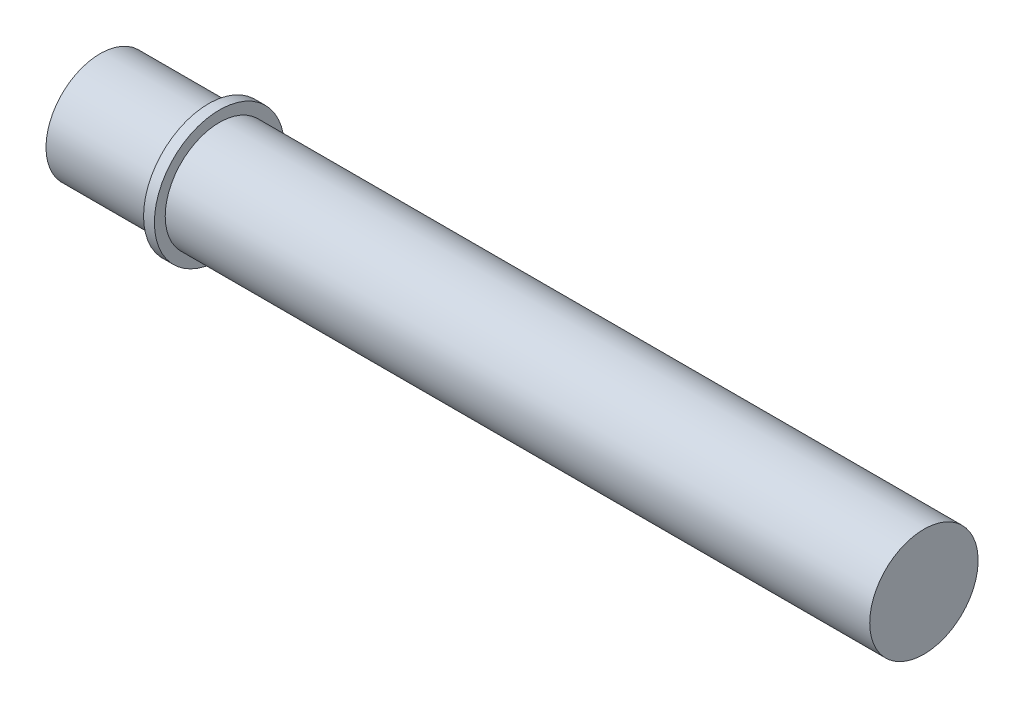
ISO-10303-21;
HEADER;
FILE_DESCRIPTION(('STEP AP214'),'2;1');
FILE_NAME('part.step','',(''),(''),'','','');
FILE_SCHEMA(('AUTOMOTIVE_DESIGN { 1 0 10303 214 1 1 1 1 }'));
ENDSEC;
DATA;
#1=APPLICATION_CONTEXT('core data for automotive mechanical design processes');
#2=APPLICATION_PROTOCOL_DEFINITION('international standard','automotive_design',2000,#1);
#3=PRODUCT_CONTEXT('',#1,'mechanical');
#4=PRODUCT('Part','Part','',(#3));
#5=PRODUCT_RELATED_PRODUCT_CATEGORY('part','',(#4));
#6=PRODUCT_DEFINITION_FORMATION('','',#4);
#7=PRODUCT_DEFINITION_CONTEXT('part definition',#1,'design');
#8=PRODUCT_DEFINITION('design','',#6,#7);
#9=PRODUCT_DEFINITION_SHAPE('','',#8);
#10=(LENGTH_UNIT() NAMED_UNIT(*) SI_UNIT(.MILLI.,.METRE.));
#11=(NAMED_UNIT(*) PLANE_ANGLE_UNIT() SI_UNIT($,.RADIAN.));
#12=(NAMED_UNIT(*) SI_UNIT($,.STERADIAN.) SOLID_ANGLE_UNIT());
#13=UNCERTAINTY_MEASURE_WITH_UNIT(LENGTH_MEASURE(1.E-05),#10,'distance_accuracy_value','');
#14=(GEOMETRIC_REPRESENTATION_CONTEXT(3) GLOBAL_UNCERTAINTY_ASSIGNED_CONTEXT((#13)) GLOBAL_UNIT_ASSIGNED_CONTEXT((#10,
#11,#12)) REPRESENTATION_CONTEXT('',''));
#15=CARTESIAN_POINT('',(0.,0.,0.));
#16=DIRECTION('',(0.,0.,1.));
#17=DIRECTION('',(1.,0.,0.));
#18=AXIS2_PLACEMENT_3D('',#15,#16,#17);
#19=CARTESIAN_POINT('',(0.,0.,0.));
#20=DIRECTION('',(1.,0.,0.));
#21=DIRECTION('',(0.,0.,-1.));
#22=AXIS2_PLACEMENT_3D('',#19,#20,#21);
#23=PLANE('',#22);
#24=CARTESIAN_POINT('',(0.,0.,0.));
#25=DIRECTION('',(-1.,0.,0.));
#26=DIRECTION('',(0.,0.,1.));
#27=AXIS2_PLACEMENT_3D('',#24,#25,#26);
#28=CIRCLE('',#27,5.);
#29=CARTESIAN_POINT('',(0.,0.,5.));
#30=VERTEX_POINT('',#29);
#31=EDGE_CURVE('E10',#30,#30,#28,.T.);
#32=ORIENTED_EDGE('',*,*,#31,.T.);
#33=EDGE_LOOP('',(#32));
#34=FACE_BOUND('',#33,.T.);
#35=ADVANCED_FACE('F22',(#34),#23,.F.);
#36=CARTESIAN_POINT('',(0.,0.,0.));
#37=DIRECTION('',(-1.,0.,0.));
#38=DIRECTION('',(0.,0.,1.));
#39=AXIS2_PLACEMENT_3D('',#36,#37,#38);
#40=CYLINDRICAL_SURFACE('',#39,5.);
#41=ORIENTED_EDGE('',*,*,#31,.F.);
#42=EDGE_LOOP('',(#41));
#43=FACE_BOUND('',#42,.T.);
#44=CARTESIAN_POINT('',(10.,0.,0.));
#45=DIRECTION('',(-1.,0.,0.));
#46=DIRECTION('',(0.,0.,1.));
#47=AXIS2_PLACEMENT_3D('',#44,#45,#46);
#48=CIRCLE('',#47,5.);
#49=CARTESIAN_POINT('',(10.,0.,5.));
#50=VERTEX_POINT('',#49);
#51=EDGE_CURVE('E28',#50,#50,#48,.T.);
#52=ORIENTED_EDGE('',*,*,#51,.T.);
#53=EDGE_LOOP('',(#52));
#54=FACE_BOUND('',#53,.T.);
#55=ADVANCED_FACE('F60',(#43,#54),#40,.T.);
#56=CARTESIAN_POINT('',(10.,5.,0.));
#57=DIRECTION('',(1.,0.,0.));
#58=DIRECTION('',(0.,0.,-1.));
#59=AXIS2_PLACEMENT_3D('',#56,#57,#58);
#60=PLANE('',#59);
#61=ORIENTED_EDGE('',*,*,#51,.F.);
#62=EDGE_LOOP('',(#61));
#63=FACE_BOUND('',#62,.T.);
#64=CARTESIAN_POINT('',(10.,0.,0.));
#65=DIRECTION('',(-1.,0.,0.));
#66=DIRECTION('',(0.,0.,1.));
#67=AXIS2_PLACEMENT_3D('',#64,#65,#66);
#68=CIRCLE('',#67,6.);
#69=CARTESIAN_POINT('',(10.,0.,6.));
#70=VERTEX_POINT('',#69);
#71=EDGE_CURVE('E32',#70,#70,#68,.T.);
#72=ORIENTED_EDGE('',*,*,#71,.T.);
#73=EDGE_LOOP('',(#72));
#74=FACE_BOUND('',#73,.T.);
#75=ADVANCED_FACE('F64',(#63,#74),#60,.F.);
#76=CARTESIAN_POINT('',(0.,0.,0.));
#77=DIRECTION('',(-1.,0.,0.));
#78=DIRECTION('',(0.,0.,1.));
#79=AXIS2_PLACEMENT_3D('',#76,#77,#78);
#80=CYLINDRICAL_SURFACE('',#79,6.);
#81=ORIENTED_EDGE('',*,*,#71,.F.);
#82=EDGE_LOOP('',(#81));
#83=FACE_BOUND('',#82,.T.);
#84=CARTESIAN_POINT('',(11.,0.,0.));
#85=DIRECTION('',(-1.,0.,0.));
#86=DIRECTION('',(0.,0.,1.));
#87=AXIS2_PLACEMENT_3D('',#84,#85,#86);
#88=CIRCLE('',#87,6.);
#89=CARTESIAN_POINT('',(11.,0.,6.));
#90=VERTEX_POINT('',#89);
#91=EDGE_CURVE('E36',#90,#90,#88,.T.);
#92=ORIENTED_EDGE('',*,*,#91,.T.);
#93=EDGE_LOOP('',(#92));
#94=FACE_BOUND('',#93,.T.);
#95=ADVANCED_FACE('F69',(#83,#94),#80,.T.);
#96=CARTESIAN_POINT('',(11.,6.,0.));
#97=DIRECTION('',(-1.,0.,0.));
#98=DIRECTION('',(0.,0.,1.));
#99=AXIS2_PLACEMENT_3D('',#96,#97,#98);
#100=PLANE('',#99);
#101=ORIENTED_EDGE('',*,*,#91,.F.);
#102=EDGE_LOOP('',(#101));
#103=FACE_BOUND('',#102,.T.);
#104=CARTESIAN_POINT('',(11.,0.,0.));
#105=DIRECTION('',(-1.,0.,0.));
#106=DIRECTION('',(0.,0.,1.));
#107=AXIS2_PLACEMENT_3D('',#104,#105,#106);
#108=CIRCLE('',#107,5.);
#109=CARTESIAN_POINT('',(11.,0.,5.));
#110=VERTEX_POINT('',#109);
#111=EDGE_CURVE('E41',#110,#110,#108,.T.);
#112=ORIENTED_EDGE('',*,*,#111,.T.);
#113=EDGE_LOOP('',(#112));
#114=FACE_BOUND('',#113,.T.);
#115=ADVANCED_FACE('F56',(#103,#114),#100,.F.);
#116=CARTESIAN_POINT('',(0.,0.,0.));
#117=DIRECTION('',(-1.,0.,0.));
#118=DIRECTION('',(0.,0.,1.));
#119=AXIS2_PLACEMENT_3D('',#116,#117,#118);
#120=CYLINDRICAL_SURFACE('',#119,5.);
#121=ORIENTED_EDGE('',*,*,#111,.F.);
#122=EDGE_LOOP('',(#121));
#123=FACE_BOUND('',#122,.T.);
#124=CARTESIAN_POINT('',(76.,0.,0.));
#125=DIRECTION('',(-1.,0.,0.));
#126=DIRECTION('',(0.,0.,1.));
#127=AXIS2_PLACEMENT_3D('',#124,#125,#126);
#128=CIRCLE('',#127,5.);
#129=CARTESIAN_POINT('',(76.,0.,5.));
#130=VERTEX_POINT('',#129);
#131=EDGE_CURVE('E44',#130,#130,#128,.T.);
#132=ORIENTED_EDGE('',*,*,#131,.T.);
#133=EDGE_LOOP('',(#132));
#134=FACE_BOUND('',#133,.T.);
#135=ADVANCED_FACE('F48',(#123,#134),#120,.T.);
#136=CARTESIAN_POINT('',(76.,5.,0.));
#137=DIRECTION('',(-1.,0.,0.));
#138=DIRECTION('',(0.,0.,1.));
#139=AXIS2_PLACEMENT_3D('',#136,#137,#138);
#140=PLANE('',#139);
#141=ORIENTED_EDGE('',*,*,#131,.F.);
#142=EDGE_LOOP('',(#141));
#143=FACE_BOUND('',#142,.T.);
#144=ADVANCED_FACE('F50',(#143),#140,.F.);
#145=CLOSED_SHELL('',(#35,#55,#75,#95,#115,#135,#144));
#146=MANIFOLD_SOLID_BREP('B2',#145);
#147=ADVANCED_BREP_SHAPE_REPRESENTATION('',(#18,#146),#14);
#148=SHAPE_DEFINITION_REPRESENTATION(#9,#147);
ENDSEC;
END-ISO-10303-21;
